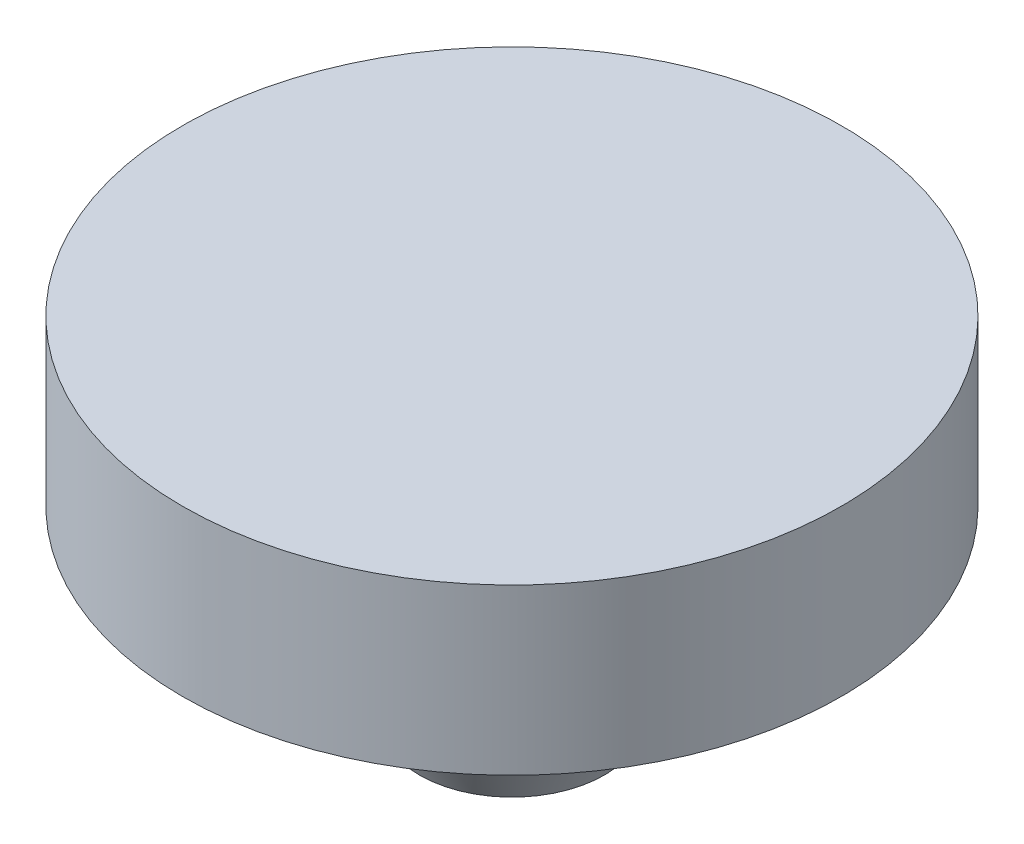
from build123d import *

# Parameters (mm, degrees)
SKETCH1_R           = 12.7
BOSS_EXTRUDE1_DEPTH = 6.35
SKETCH2_R           = 4.7625
BOSS_EXTRUDE2_DEPTH = 2.286


with BuildPart() as part:
    # Sketch1 → Boss-Extrude1 (new body)
    with BuildSketch(Plane(origin=(0, 0, 0), x_dir=(1, 0, 0), z_dir=(0, 1, 0))):
        with Locations(Location((0, 0, 0), (0, 0, 270))):
            Circle(SKETCH1_R)
    extrude(amount=BOSS_EXTRUDE1_DEPTH)

    # Sketch2 → Boss-Extrude2 (add)
    with BuildSketch(Plane.XZ):
        with Locations(Location((0, 0, 0), (0, 0, 90))):
            Circle(SKETCH2_R)
    extrude(amount=BOSS_EXTRUDE2_DEPTH)

    # Sketch3 → Revolve1 (revolve)
    with BuildSketch(Plane(origin=(0, 0, 0), x_dir=(0, 0, -1), z_dir=(1, 0, 0)), mode=Mode.PRIVATE) as revolve1_sk:
        Polygon((0, -2.286), (6.35, -2.286), (3.5687, -7.1882), (0, -7.1882), align=None)
    revolve(revolve1_sk.sketch.rotate(Axis((0, 0, 0), (0, -1, 0)), 180), axis=Axis((0, 0, 0), (0, -1, 0)))


solid = part.part
